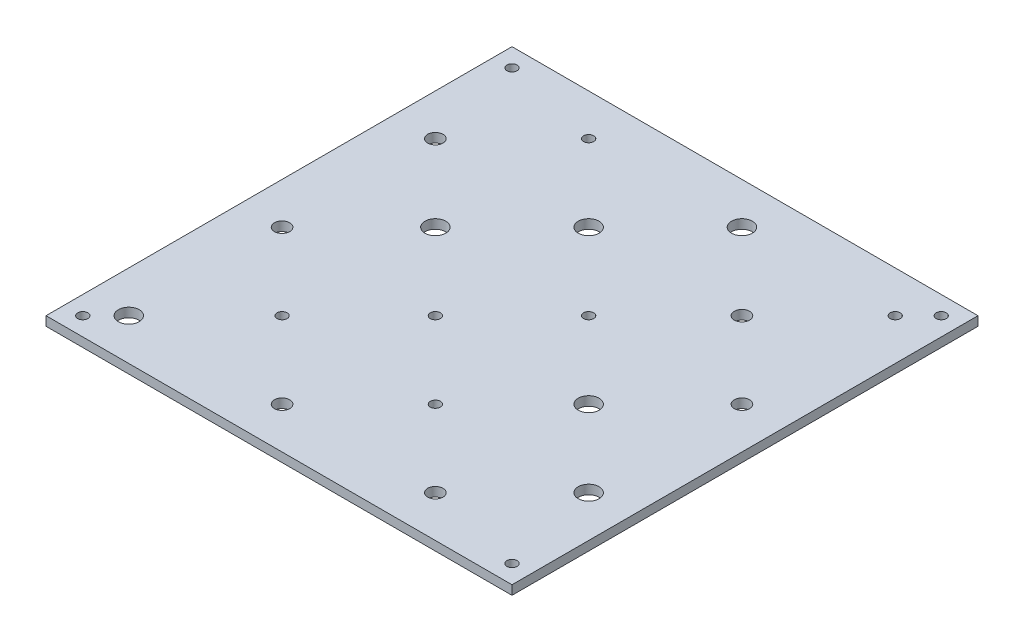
from build123d import *

# Parameters (mm, degrees)
SKETCH2_W                    = 152
SKETCH2_H                    = 152
BOSS_EXTRUDE2_DEPTH          = 3
TAP_DRILL_FOR_M4X0_7_TAP1_D  = 3.3
TAP_DRILL_FOR_M6X1_0_TAP1_D  = 5
TAP_DRILL_FOR_M8X1_25_TAP1_D = 6.8
TAP_DRILL_FOR_M4X0_7_TAP2_D  = 3.3


with BuildPart() as part:
    # Sketch2 → Boss-Extrude2 (new body)
    with BuildSketch(Plane(origin=(0, 0, 0), x_dir=(1, 0, 0), z_dir=(0, 1, 0))):
        Rectangle(SKETCH2_W, SKETCH2_H)
    extrude(amount=BOSS_EXTRUDE2_DEPTH)

    # Tap Drill for M4x0.7 Tap1 (through all)
    with Locations(Plane(origin=(0, 3, 0), x_dir=(1, 0, 0), z_dir=(0, 1, 0))):
        with Locations((-37.5, 62.5), (62.5, 62.5), (12.5, 12.5), (-37.5, -37.5), (-12.5, -12.5), (12.5, -37.5)):
            Hole(TAP_DRILL_FOR_M4X0_7_TAP1_D / 2)

    # Tap Drill for M6x1.0 Tap1 (through all)
    with Locations(Plane(origin=(0, 3, 0), x_dir=(1, 0, 0), z_dir=(0, 1, 0))):
        with Locations((37.5, 37.5), (-62.5, 37.5), (62.5, 12.5), (37.5, -62.5), (-12.5, -62.5), (-62.5, -12.5), (176.187767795, 220.177696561)):
            Hole(TAP_DRILL_FOR_M6X1_0_TAP1_D / 2)

    # Tap Drill for M8x1.25 Tap1 (through all)
    with Locations(Plane(origin=(0, 3, 0), x_dir=(1, 0, 0), z_dir=(0, 1, 0))):
        with Locations((62.5, -37.5), (37.5, -12.5), (-12.5, 37.5), (12.5, 62.5), (-62.5, -62.5), (-37.5, 12.5)):
            Hole(TAP_DRILL_FOR_M8X1_25_TAP1_D / 2)

    # Tap Drill for M4x0.7 Tap2 (through all)
    with Locations(Plane(origin=(0, 3, 0), x_dir=(1, 0, 0), z_dir=(0, 1, 0))):
        with Locations((-70, 70), (70, 70), (-70, -70), (70, -70)):
            Hole(TAP_DRILL_FOR_M4X0_7_TAP2_D / 2)


solid = part.part
